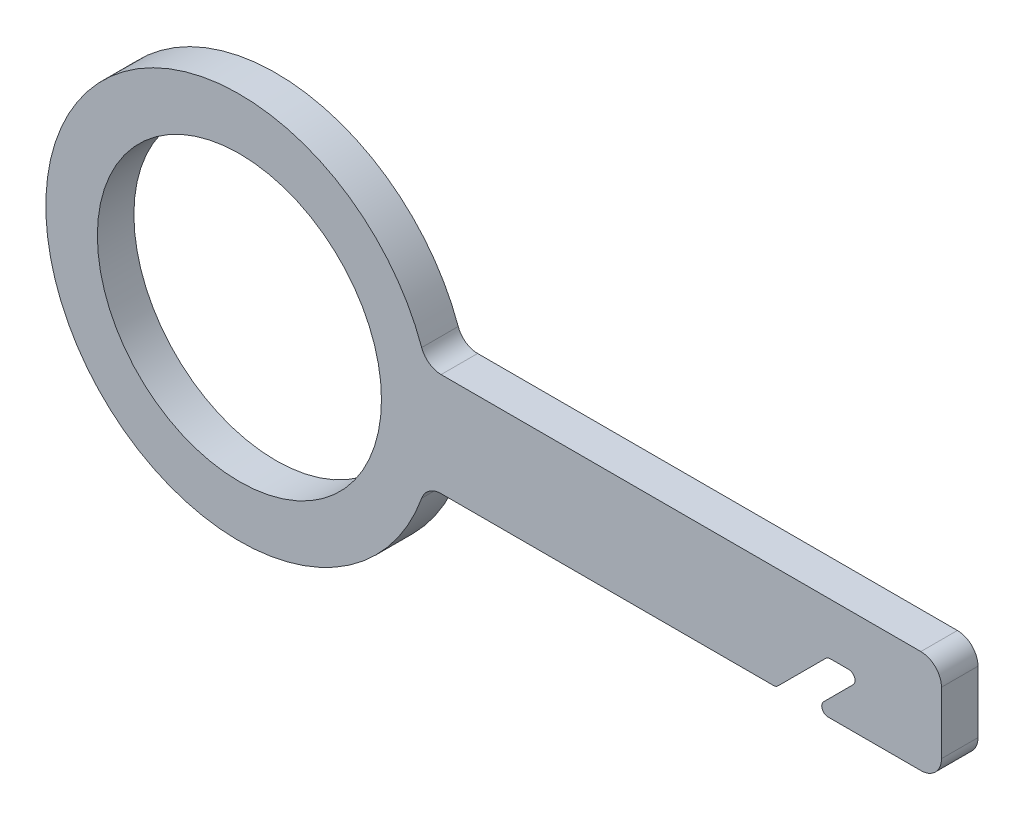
ISO-10303-21;
HEADER;
FILE_DESCRIPTION(('STEP AP214'),'2;1');
FILE_NAME('part.step','',(''),(''),'','','');
FILE_SCHEMA(('AUTOMOTIVE_DESIGN { 1 0 10303 214 1 1 1 1 }'));
ENDSEC;
DATA;
#1=APPLICATION_CONTEXT('core data for automotive mechanical design processes');
#2=APPLICATION_PROTOCOL_DEFINITION('international standard','automotive_design',2000,#1);
#3=PRODUCT_CONTEXT('',#1,'mechanical');
#4=PRODUCT('Part','Part','',(#3));
#5=PRODUCT_RELATED_PRODUCT_CATEGORY('part','',(#4));
#6=PRODUCT_DEFINITION_FORMATION('','',#4);
#7=PRODUCT_DEFINITION_CONTEXT('part definition',#1,'design');
#8=PRODUCT_DEFINITION('design','',#6,#7);
#9=PRODUCT_DEFINITION_SHAPE('','',#8);
#10=(LENGTH_UNIT() NAMED_UNIT(*) SI_UNIT(.MILLI.,.METRE.));
#11=(NAMED_UNIT(*) PLANE_ANGLE_UNIT() SI_UNIT($,.RADIAN.));
#12=(NAMED_UNIT(*) SI_UNIT($,.STERADIAN.) SOLID_ANGLE_UNIT());
#13=UNCERTAINTY_MEASURE_WITH_UNIT(LENGTH_MEASURE(1.E-05),#10,'distance_accuracy_value','');
#14=(GEOMETRIC_REPRESENTATION_CONTEXT(3) GLOBAL_UNCERTAINTY_ASSIGNED_CONTEXT((#13)) GLOBAL_UNIT_ASSIGNED_CONTEXT((#10,
#11,#12)) REPRESENTATION_CONTEXT('',''));
#15=CARTESIAN_POINT('',(0.,0.,0.));
#16=DIRECTION('',(0.,0.,1.));
#17=DIRECTION('',(1.,0.,0.));
#18=AXIS2_PLACEMENT_3D('',#15,#16,#17);
#19=CARTESIAN_POINT('',(0.,6.35,4.5));
#20=DIRECTION('',(0.,1.,0.));
#21=DIRECTION('',(0.,0.,1.));
#22=AXIS2_PLACEMENT_3D('',#19,#20,#21);
#23=PLANE('',#22);
#24=DIRECTION('',(1.,0.,0.));
#25=VECTOR('',#24,1.);
#26=CARTESIAN_POINT('',(0.,6.35,0.));
#27=LINE('',#26,#25);
#28=CARTESIAN_POINT('',(24.8475350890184,6.35,0.));
#29=VERTEX_POINT('',#28);
#30=CARTESIAN_POINT('',(83.9491278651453,6.35,0.));
#31=VERTEX_POINT('',#30);
#32=EDGE_CURVE('E180',#29,#31,#27,.T.);
#33=ORIENTED_EDGE('',*,*,#32,.F.);
#34=DIRECTION('',(0.,0.,-1.));
#35=VECTOR('',#34,1.);
#36=CARTESIAN_POINT('',(24.8475350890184,6.35,4.5));
#37=LINE('',#36,#35);
#38=CARTESIAN_POINT('',(24.8475350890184,6.35,4.5));
#39=VERTEX_POINT('',#38);
#40=EDGE_CURVE('E155',#29,#39,#37,.F.);
#41=ORIENTED_EDGE('',*,*,#40,.T.);
#42=DIRECTION('',(1.,0.,0.));
#43=VECTOR('',#42,1.);
#44=CARTESIAN_POINT('',(0.,6.35,4.5));
#45=LINE('',#44,#43);
#46=CARTESIAN_POINT('',(83.9491278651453,6.35,4.5));
#47=VERTEX_POINT('',#46);
#48=EDGE_CURVE('E202',#39,#47,#45,.T.);
#49=ORIENTED_EDGE('',*,*,#48,.T.);
#50=DIRECTION('',(0.,0.,-1.));
#51=VECTOR('',#50,1.);
#52=CARTESIAN_POINT('',(83.9491278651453,6.35,4.5));
#53=LINE('',#52,#51);
#54=EDGE_CURVE('E171',#47,#31,#53,.T.);
#55=ORIENTED_EDGE('',*,*,#54,.T.);
#56=EDGE_LOOP('',(#33,#41,#49,#55));
#57=FACE_BOUND('',#56,.T.);
#58=ADVANCED_FACE('F35',(#57),#23,.T.);
#59=CARTESIAN_POINT('',(0.,0.,4.5));
#60=DIRECTION('',(0.,0.,-1.));
#61=DIRECTION('',(-1.,0.,0.));
#62=AXIS2_PLACEMENT_3D('',#59,#60,#61);
#63=CYLINDRICAL_SURFACE('',#62,23.85);
#64=CARTESIAN_POINT('',(0.,0.,4.5));
#65=DIRECTION('',(0.,0.,1.));
#66=DIRECTION('',(1.,0.,0.));
#67=AXIS2_PLACEMENT_3D('',#64,#65,#66);
#68=CIRCLE('',#67,23.85);
#69=CARTESIAN_POINT('',(22.4559951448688,8.03435013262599,4.5));
#70=VERTEX_POINT('',#69);
#71=CARTESIAN_POINT('',(22.4559951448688,-8.03435013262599,4.5));
#72=VERTEX_POINT('',#71);
#73=EDGE_CURVE('E170',#70,#72,#68,.T.);
#74=ORIENTED_EDGE('',*,*,#73,.F.);
#75=DIRECTION('',(0.,0.,-1.));
#76=VECTOR('',#75,1.);
#77=CARTESIAN_POINT('',(22.4559951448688,8.03435013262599,4.5));
#78=LINE('',#77,#76);
#79=CARTESIAN_POINT('',(22.4559951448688,8.03435013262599,0.));
#80=VERTEX_POINT('',#79);
#81=EDGE_CURVE('E154',#70,#80,#78,.T.);
#82=ORIENTED_EDGE('',*,*,#81,.T.);
#83=CARTESIAN_POINT('',(0.,0.,0.));
#84=DIRECTION('',(0.,0.,1.));
#85=DIRECTION('',(1.,0.,0.));
#86=AXIS2_PLACEMENT_3D('',#83,#84,#85);
#87=CIRCLE('',#86,23.85);
#88=CARTESIAN_POINT('',(22.4559951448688,-8.03435013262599,0.));
#89=VERTEX_POINT('',#88);
#90=EDGE_CURVE('E167',#80,#89,#87,.T.);
#91=ORIENTED_EDGE('',*,*,#90,.T.);
#92=DIRECTION('',(0.,0.,-1.));
#93=VECTOR('',#92,1.);
#94=CARTESIAN_POINT('',(22.4559951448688,-8.03435013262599,4.5));
#95=LINE('',#94,#93);
#96=EDGE_CURVE('E172',#89,#72,#95,.F.);
#97=ORIENTED_EDGE('',*,*,#96,.T.);
#98=EDGE_LOOP('',(#74,#82,#91,#97));
#99=FACE_BOUND('',#98,.T.);
#100=ADVANCED_FACE('F166',(#99),#63,.T.);
#101=CARTESIAN_POINT('',(0.,-6.35,4.5));
#102=DIRECTION('',(0.,-1.,0.));
#103=DIRECTION('',(1.,0.,0.));
#104=AXIS2_PLACEMENT_3D('',#101,#102,#103);
#105=PLANE('',#104);
#106=DIRECTION('',(-1.,0.,0.));
#107=VECTOR('',#106,1.);
#108=CARTESIAN_POINT('',(0.,-6.35,0.));
#109=LINE('',#108,#107);
#110=CARTESIAN_POINT('',(65.7853458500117,-6.34999999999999,0.));
#111=VERTEX_POINT('',#110);
#112=CARTESIAN_POINT('',(24.8475350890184,-6.35,0.));
#113=VERTEX_POINT('',#112);
#114=EDGE_CURVE('E179',#111,#113,#109,.T.);
#115=ORIENTED_EDGE('',*,*,#114,.F.);
#116=DIRECTION('',(0.,0.,-1.));
#117=VECTOR('',#116,1.);
#118=CARTESIAN_POINT('',(65.7853458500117,-6.34999999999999,4.5));
#119=LINE('',#118,#117);
#120=CARTESIAN_POINT('',(65.7853458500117,-6.34999999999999,4.5));
#121=VERTEX_POINT('',#120);
#122=EDGE_CURVE('E58',#111,#121,#119,.F.);
#123=ORIENTED_EDGE('',*,*,#122,.T.);
#124=DIRECTION('',(-1.,0.,0.));
#125=VECTOR('',#124,1.);
#126=CARTESIAN_POINT('',(0.,-6.35,4.5));
#127=LINE('',#126,#125);
#128=CARTESIAN_POINT('',(24.8475350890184,-6.35,4.5));
#129=VERTEX_POINT('',#128);
#130=EDGE_CURVE('E283',#121,#129,#127,.T.);
#131=ORIENTED_EDGE('',*,*,#130,.T.);
#132=DIRECTION('',(0.,0.,-1.));
#133=VECTOR('',#132,1.);
#134=CARTESIAN_POINT('',(24.8475350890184,-6.35,4.5));
#135=LINE('',#134,#133);
#136=EDGE_CURVE('E161',#129,#113,#135,.T.);
#137=ORIENTED_EDGE('',*,*,#136,.T.);
#138=EDGE_LOOP('',(#115,#123,#131,#137));
#139=FACE_BOUND('',#138,.T.);
#140=ADVANCED_FACE('F309',(#139),#105,.T.);
#141=CARTESIAN_POINT('',(36.2320639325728,-36.2320639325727,4.5));
#142=DIRECTION('',(-0.707106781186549,0.707106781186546,0.));
#143=DIRECTION('',(-0.707106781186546,-0.707106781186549,0.));
#144=AXIS2_PLACEMENT_3D('',#141,#142,#143);
#145=PLANE('',#144);
#146=DIRECTION('',(0.707106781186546,0.707106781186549,0.));
#147=VECTOR('',#146,1.);
#148=CARTESIAN_POINT('',(36.2320639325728,-36.2320639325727,0.));
#149=LINE('',#148,#147);
#150=CARTESIAN_POINT('',(66.3466118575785,-6.11751600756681,0.));
#151=VERTEX_POINT('',#150);
#152=CARTESIAN_POINT('',(72.2316438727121,-0.232483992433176,0.));
#153=VERTEX_POINT('',#152);
#154=EDGE_CURVE('E182',#151,#153,#149,.T.);
#155=ORIENTED_EDGE('',*,*,#154,.T.);
#156=DIRECTION('',(0.,0.,-1.));
#157=VECTOR('',#156,1.);
#158=CARTESIAN_POINT('',(72.2316438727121,-0.232483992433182,4.5));
#159=LINE('',#158,#157);
#160=CARTESIAN_POINT('',(72.2316438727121,-0.232483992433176,4.5));
#161=VERTEX_POINT('',#160);
#162=EDGE_CURVE('E238',#153,#161,#159,.F.);
#163=ORIENTED_EDGE('',*,*,#162,.T.);
#164=DIRECTION('',(0.707106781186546,0.707106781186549,0.));
#165=VECTOR('',#164,1.);
#166=CARTESIAN_POINT('',(36.2320639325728,-36.2320639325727,4.5));
#167=LINE('',#166,#165);
#168=CARTESIAN_POINT('',(66.3466118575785,-6.11751600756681,4.5));
#169=VERTEX_POINT('',#168);
#170=EDGE_CURVE('E284',#169,#161,#167,.T.);
#171=ORIENTED_EDGE('',*,*,#170,.F.);
#172=DIRECTION('',(0.,0.,-1.));
#173=VECTOR('',#172,1.);
#174=CARTESIAN_POINT('',(66.3466118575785,-6.11751600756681,0.));
#175=LINE('',#174,#173);
#176=EDGE_CURVE('E235',#169,#151,#175,.T.);
#177=ORIENTED_EDGE('',*,*,#176,.T.);
#178=EDGE_LOOP('',(#155,#163,#171,#177));
#179=FACE_BOUND('',#178,.T.);
#180=ADVANCED_FACE('F345',(#179),#145,.F.);
#181=CARTESIAN_POINT('',(0.,0.,4.5));
#182=DIRECTION('',(0.,1.,0.));
#183=DIRECTION('',(0.,0.,1.));
#184=AXIS2_PLACEMENT_3D('',#181,#182,#183);
#185=PLANE('',#184);
#186=DIRECTION('',(1.,0.,0.));
#187=VECTOR('',#186,1.);
#188=CARTESIAN_POINT('',(0.,0.,4.5));
#189=LINE('',#188,#187);
#190=CARTESIAN_POINT('',(72.792909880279,0.,4.5));
#191=VERTEX_POINT('',#190);
#192=CARTESIAN_POINT('',(75.0478458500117,0.,4.5));
#193=VERTEX_POINT('',#192);
#194=EDGE_CURVE('E275',#191,#193,#189,.T.);
#195=ORIENTED_EDGE('',*,*,#194,.F.);
#196=DIRECTION('',(0.,0.,-1.));
#197=VECTOR('',#196,1.);
#198=CARTESIAN_POINT('',(72.792909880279,0.,0.));
#199=LINE('',#198,#197);
#200=CARTESIAN_POINT('',(72.792909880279,0.,0.));
#201=VERTEX_POINT('',#200);
#202=EDGE_CURVE('E232',#191,#201,#199,.T.);
#203=ORIENTED_EDGE('',*,*,#202,.T.);
#204=DIRECTION('',(1.,0.,0.));
#205=VECTOR('',#204,1.);
#206=CARTESIAN_POINT('',(0.,0.,0.));
#207=LINE('',#206,#205);
#208=CARTESIAN_POINT('',(75.0478458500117,0.,0.));
#209=VERTEX_POINT('',#208);
#210=EDGE_CURVE('E190',#201,#209,#207,.T.);
#211=ORIENTED_EDGE('',*,*,#210,.T.);
#212=DIRECTION('',(0.,0.,-1.));
#213=VECTOR('',#212,1.);
#214=CARTESIAN_POINT('',(75.0478458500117,0.,4.5));
#215=LINE('',#214,#213);
#216=EDGE_CURVE('E230',#209,#193,#215,.F.);
#217=ORIENTED_EDGE('',*,*,#216,.T.);
#218=EDGE_LOOP('',(#195,#203,#211,#217));
#219=FACE_BOUND('',#218,.T.);
#220=ADVANCED_FACE('F266',(#219),#185,.F.);
#221=CARTESIAN_POINT('',(38.4820639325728,-38.4820639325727,4.5));
#222=DIRECTION('',(0.707106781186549,-0.707106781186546,0.));
#223=DIRECTION('',(0.707106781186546,0.707106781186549,0.));
#224=AXIS2_PLACEMENT_3D('',#221,#222,#223);
#225=PLANE('',#224);
#226=DIRECTION('',(-0.707106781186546,-0.707106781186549,0.));
#227=VECTOR('',#226,1.);
#228=CARTESIAN_POINT('',(38.4820639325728,-38.4820639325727,4.5));
#229=LINE('',#228,#227);
#230=CARTESIAN_POINT('',(75.6091118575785,-1.35501600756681,4.5));
#231=VERTEX_POINT('',#230);
#232=CARTESIAN_POINT('',(71.9691438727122,-4.99498399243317,4.5));
#233=VERTEX_POINT('',#232);
#234=EDGE_CURVE('E274',#231,#233,#229,.T.);
#235=ORIENTED_EDGE('',*,*,#234,.F.);
#236=DIRECTION('',(0.,0.,-1.));
#237=VECTOR('',#236,1.);
#238=CARTESIAN_POINT('',(75.6091118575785,-1.35501600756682,0.));
#239=LINE('',#238,#237);
#240=CARTESIAN_POINT('',(75.6091118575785,-1.35501600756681,0.));
#241=VERTEX_POINT('',#240);
#242=EDGE_CURVE('E242',#231,#241,#239,.T.);
#243=ORIENTED_EDGE('',*,*,#242,.T.);
#244=DIRECTION('',(-0.707106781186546,-0.707106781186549,0.));
#245=VECTOR('',#244,1.);
#246=CARTESIAN_POINT('',(38.4820639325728,-38.4820639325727,0.));
#247=LINE('',#246,#245);
#248=CARTESIAN_POINT('',(71.9691438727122,-4.99498399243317,0.));
#249=VERTEX_POINT('',#248);
#250=EDGE_CURVE('E193',#241,#249,#247,.T.);
#251=ORIENTED_EDGE('',*,*,#250,.T.);
#252=DIRECTION('',(0.,0.,-1.));
#253=VECTOR('',#252,1.);
#254=CARTESIAN_POINT('',(71.9691438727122,-4.99498399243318,4.5));
#255=LINE('',#254,#253);
#256=EDGE_CURVE('E240',#249,#233,#255,.F.);
#257=ORIENTED_EDGE('',*,*,#256,.T.);
#258=EDGE_LOOP('',(#235,#243,#251,#257));
#259=FACE_BOUND('',#258,.T.);
#260=ADVANCED_FACE('F277',(#259),#225,.F.);
#261=CARTESIAN_POINT('',(83.9491278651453,-6.34999999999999,4.5));
#262=VERTEX_POINT('',#261);
#263=CARTESIAN_POINT('',(72.530409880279,-6.34999999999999,4.5));
#264=VERTEX_POINT('',#263);
#265=EDGE_CURVE('E279',#262,#264,#127,.T.);
#266=ORIENTED_EDGE('',*,*,#265,.T.);
#267=DIRECTION('',(0.,0.,-1.));
#268=VECTOR('',#267,1.);
#269=CARTESIAN_POINT('',(72.530409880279,-6.34999999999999,0.));
#270=LINE('',#269,#268);
#271=CARTESIAN_POINT('',(72.530409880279,-6.34999999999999,0.));
#272=VERTEX_POINT('',#271);
#273=EDGE_CURVE('E253',#264,#272,#270,.T.);
#274=ORIENTED_EDGE('',*,*,#273,.T.);
#275=CARTESIAN_POINT('',(83.9491278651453,-6.34999999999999,0.));
#276=VERTEX_POINT('',#275);
#277=EDGE_CURVE('E184',#276,#272,#109,.T.);
#278=ORIENTED_EDGE('',*,*,#277,.F.);
#279=DIRECTION('',(0.,0.,-1.));
#280=VECTOR('',#279,1.);
#281=CARTESIAN_POINT('',(83.9491278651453,-6.34999999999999,4.5));
#282=LINE('',#281,#280);
#283=EDGE_CURVE('E221',#276,#262,#282,.F.);
#284=ORIENTED_EDGE('',*,*,#283,.T.);
#285=EDGE_LOOP('',(#266,#274,#278,#284));
#286=FACE_BOUND('',#285,.T.);
#287=ADVANCED_FACE('F363',(#286),#105,.T.);
#288=CARTESIAN_POINT('',(86.4891278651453,0.,4.5));
#289=DIRECTION('',(1.,0.,0.));
#290=DIRECTION('',(0.,0.,-1.));
#291=AXIS2_PLACEMENT_3D('',#288,#289,#290);
#292=PLANE('',#291);
#293=DIRECTION('',(0.,-1.,0.));
#294=VECTOR('',#293,1.);
#295=CARTESIAN_POINT('',(86.4891278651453,0.,0.));
#296=LINE('',#295,#294);
#297=CARTESIAN_POINT('',(86.4891278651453,3.81,0.));
#298=VERTEX_POINT('',#297);
#299=CARTESIAN_POINT('',(86.4891278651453,-3.80999999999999,0.));
#300=VERTEX_POINT('',#299);
#301=EDGE_CURVE('E196',#298,#300,#296,.T.);
#302=ORIENTED_EDGE('',*,*,#301,.F.);
#303=DIRECTION('',(0.,0.,-1.));
#304=VECTOR('',#303,1.);
#305=CARTESIAN_POINT('',(86.4891278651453,3.81,4.5));
#306=LINE('',#305,#304);
#307=CARTESIAN_POINT('',(86.4891278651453,3.81,4.5));
#308=VERTEX_POINT('',#307);
#309=EDGE_CURVE('E215',#298,#308,#306,.F.);
#310=ORIENTED_EDGE('',*,*,#309,.T.);
#311=DIRECTION('',(0.,-1.,0.));
#312=VECTOR('',#311,1.);
#313=CARTESIAN_POINT('',(86.4891278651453,0.,4.5));
#314=LINE('',#313,#312);
#315=CARTESIAN_POINT('',(86.4891278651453,-3.80999999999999,4.5));
#316=VERTEX_POINT('',#315);
#317=EDGE_CURVE('E281',#308,#316,#314,.T.);
#318=ORIENTED_EDGE('',*,*,#317,.T.);
#319=DIRECTION('',(0.,0.,-1.));
#320=VECTOR('',#319,1.);
#321=CARTESIAN_POINT('',(86.4891278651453,-3.80999999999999,4.5));
#322=LINE('',#321,#320);
#323=EDGE_CURVE('E212',#316,#300,#322,.T.);
#324=ORIENTED_EDGE('',*,*,#323,.T.);
#325=EDGE_LOOP('',(#302,#310,#318,#324));
#326=FACE_BOUND('',#325,.T.);
#327=ADVANCED_FACE('F301',(#326),#292,.T.);
#328=CARTESIAN_POINT('',(0.,0.,4.5));
#329=DIRECTION('',(0.,0.,-1.));
#330=DIRECTION('',(-1.,0.,0.));
#331=AXIS2_PLACEMENT_3D('',#328,#329,#330);
#332=CYLINDRICAL_SURFACE('',#331,17.5);
#333=CARTESIAN_POINT('',(0.,0.,4.5));
#334=DIRECTION('',(0.,0.,1.));
#335=DIRECTION('',(1.,0.,0.));
#336=AXIS2_PLACEMENT_3D('',#333,#334,#335);
#337=CIRCLE('',#336,17.5);
#338=CARTESIAN_POINT('',(17.5,0.,4.5));
#339=VERTEX_POINT('',#338);
#340=EDGE_CURVE('E203',#339,#339,#337,.T.);
#341=ORIENTED_EDGE('',*,*,#340,.T.);
#342=EDGE_LOOP('',(#341));
#343=FACE_BOUND('',#342,.T.);
#344=CARTESIAN_POINT('',(0.,0.,0.));
#345=DIRECTION('',(0.,0.,1.));
#346=DIRECTION('',(1.,0.,0.));
#347=AXIS2_PLACEMENT_3D('',#344,#345,#346);
#348=CIRCLE('',#347,17.5);
#349=CARTESIAN_POINT('',(17.5,0.,0.));
#350=VERTEX_POINT('',#349);
#351=EDGE_CURVE('E199',#350,#350,#348,.T.);
#352=ORIENTED_EDGE('',*,*,#351,.F.);
#353=EDGE_LOOP('',(#352));
#354=FACE_BOUND('',#353,.T.);
#355=ADVANCED_FACE('F292',(#343,#354),#332,.F.);
#356=CARTESIAN_POINT('',(0.,0.,4.5));
#357=DIRECTION('',(0.,0.,1.));
#358=DIRECTION('',(1.,0.,0.));
#359=AXIS2_PLACEMENT_3D('',#356,#357,#358);
#360=PLANE('',#359);
#361=ORIENTED_EDGE('',*,*,#130,.F.);
#362=CARTESIAN_POINT('',(65.7853458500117,-5.55624999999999,4.5));
#363=DIRECTION('',(0.,0.,1.));
#364=DIRECTION('',(1.,0.,0.));
#365=AXIS2_PLACEMENT_3D('',#362,#363,#364);
#366=CIRCLE('',#365,0.79375);
#367=EDGE_CURVE('E251',#121,#169,#366,.T.);
#368=ORIENTED_EDGE('',*,*,#367,.T.);
#369=ORIENTED_EDGE('',*,*,#170,.T.);
#370=CARTESIAN_POINT('',(72.792909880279,-0.79375,4.5));
#371=DIRECTION('',(0.,0.,1.));
#372=DIRECTION('',(1.,0.,0.));
#373=AXIS2_PLACEMENT_3D('',#370,#371,#372);
#374=CIRCLE('',#373,0.79375);
#375=EDGE_CURVE('E258',#161,#191,#374,.F.);
#376=ORIENTED_EDGE('',*,*,#375,.T.);
#377=ORIENTED_EDGE('',*,*,#194,.T.);
#378=CARTESIAN_POINT('',(75.0478458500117,-0.793750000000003,4.5));
#379=DIRECTION('',(0.,0.,1.));
#380=DIRECTION('',(1.,0.,0.));
#381=AXIS2_PLACEMENT_3D('',#378,#379,#380);
#382=CIRCLE('',#381,0.79375);
#383=EDGE_CURVE('E11',#193,#231,#382,.F.);
#384=ORIENTED_EDGE('',*,*,#383,.T.);
#385=ORIENTED_EDGE('',*,*,#234,.T.);
#386=CARTESIAN_POINT('',(72.530409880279,-5.55624999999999,4.5));
#387=DIRECTION('',(0.,0.,1.));
#388=DIRECTION('',(1.,0.,0.));
#389=AXIS2_PLACEMENT_3D('',#386,#387,#388);
#390=CIRCLE('',#389,0.79375);
#391=EDGE_CURVE('E50',#233,#264,#390,.T.);
#392=ORIENTED_EDGE('',*,*,#391,.T.);
#393=ORIENTED_EDGE('',*,*,#265,.F.);
#394=CARTESIAN_POINT('',(83.9491278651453,-3.80999999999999,4.5));
#395=DIRECTION('',(0.,0.,1.));
#396=DIRECTION('',(1.,0.,0.));
#397=AXIS2_PLACEMENT_3D('',#394,#395,#396);
#398=CIRCLE('',#397,2.54);
#399=EDGE_CURVE('E217',#262,#316,#398,.T.);
#400=ORIENTED_EDGE('',*,*,#399,.T.);
#401=ORIENTED_EDGE('',*,*,#317,.F.);
#402=CARTESIAN_POINT('',(83.9491278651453,3.81,4.5));
#403=DIRECTION('',(0.,0.,1.));
#404=DIRECTION('',(1.,0.,0.));
#405=AXIS2_PLACEMENT_3D('',#402,#403,#404);
#406=CIRCLE('',#405,2.54);
#407=EDGE_CURVE('E219',#308,#47,#406,.T.);
#408=ORIENTED_EDGE('',*,*,#407,.T.);
#409=ORIENTED_EDGE('',*,*,#48,.F.);
#410=CARTESIAN_POINT('',(24.8475350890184,8.89,4.5));
#411=DIRECTION('',(0.,0.,1.));
#412=DIRECTION('',(1.,0.,0.));
#413=AXIS2_PLACEMENT_3D('',#410,#411,#412);
#414=CIRCLE('',#413,2.54);
#415=EDGE_CURVE('E160',#39,#70,#414,.F.);
#416=ORIENTED_EDGE('',*,*,#415,.T.);
#417=ORIENTED_EDGE('',*,*,#73,.T.);
#418=CARTESIAN_POINT('',(24.8475350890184,-8.89,4.5));
#419=DIRECTION('',(0.,0.,1.));
#420=DIRECTION('',(1.,0.,0.));
#421=AXIS2_PLACEMENT_3D('',#418,#419,#420);
#422=CIRCLE('',#421,2.54);
#423=EDGE_CURVE('E227',#72,#129,#422,.F.);
#424=ORIENTED_EDGE('',*,*,#423,.T.);
#425=EDGE_LOOP('',(#361,#368,#369,#376,#377,#384,#385,#392,#393,#400,#401,#408,#409,#416,#417,#424));
#426=FACE_BOUND('',#425,.T.);
#427=ORIENTED_EDGE('',*,*,#340,.F.);
#428=EDGE_LOOP('',(#427));
#429=FACE_BOUND('',#428,.T.);
#430=ADVANCED_FACE('F272',(#426,#429),#360,.T.);
#431=CARTESIAN_POINT('',(0.,0.,0.));
#432=DIRECTION('',(0.,0.,1.));
#433=DIRECTION('',(1.,0.,0.));
#434=AXIS2_PLACEMENT_3D('',#431,#432,#433);
#435=PLANE('',#434);
#436=ORIENTED_EDGE('',*,*,#154,.F.);
#437=CARTESIAN_POINT('',(65.7853458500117,-5.55624999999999,0.));
#438=DIRECTION('',(0.,0.,1.));
#439=DIRECTION('',(1.,0.,0.));
#440=AXIS2_PLACEMENT_3D('',#437,#438,#439);
#441=CIRCLE('',#440,0.79375);
#442=EDGE_CURVE('E247',#151,#111,#441,.F.);
#443=ORIENTED_EDGE('',*,*,#442,.T.);
#444=ORIENTED_EDGE('',*,*,#114,.T.);
#445=CARTESIAN_POINT('',(24.8475350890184,-8.89,0.));
#446=DIRECTION('',(0.,0.,1.));
#447=DIRECTION('',(1.,0.,0.));
#448=AXIS2_PLACEMENT_3D('',#445,#446,#447);
#449=CIRCLE('',#448,2.54);
#450=EDGE_CURVE('E178',#113,#89,#449,.T.);
#451=ORIENTED_EDGE('',*,*,#450,.T.);
#452=ORIENTED_EDGE('',*,*,#90,.F.);
#453=CARTESIAN_POINT('',(24.8475350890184,8.89,0.));
#454=DIRECTION('',(0.,0.,1.));
#455=DIRECTION('',(1.,0.,0.));
#456=AXIS2_PLACEMENT_3D('',#453,#454,#455);
#457=CIRCLE('',#456,2.54);
#458=EDGE_CURVE('E150',#80,#29,#457,.T.);
#459=ORIENTED_EDGE('',*,*,#458,.T.);
#460=ORIENTED_EDGE('',*,*,#32,.T.);
#461=CARTESIAN_POINT('',(83.9491278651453,3.81,0.));
#462=DIRECTION('',(0.,0.,1.));
#463=DIRECTION('',(1.,0.,0.));
#464=AXIS2_PLACEMENT_3D('',#461,#462,#463);
#465=CIRCLE('',#464,2.54);
#466=EDGE_CURVE('E210',#31,#298,#465,.F.);
#467=ORIENTED_EDGE('',*,*,#466,.T.);
#468=ORIENTED_EDGE('',*,*,#301,.T.);
#469=CARTESIAN_POINT('',(83.9491278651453,-3.80999999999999,0.));
#470=DIRECTION('',(0.,0.,1.));
#471=DIRECTION('',(1.,0.,0.));
#472=AXIS2_PLACEMENT_3D('',#469,#470,#471);
#473=CIRCLE('',#472,2.54);
#474=EDGE_CURVE('E208',#300,#276,#473,.F.);
#475=ORIENTED_EDGE('',*,*,#474,.T.);
#476=ORIENTED_EDGE('',*,*,#277,.T.);
#477=CARTESIAN_POINT('',(72.530409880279,-5.55624999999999,0.));
#478=DIRECTION('',(0.,0.,1.));
#479=DIRECTION('',(1.,0.,0.));
#480=AXIS2_PLACEMENT_3D('',#477,#478,#479);
#481=CIRCLE('',#480,0.79375);
#482=EDGE_CURVE('E245',#272,#249,#481,.F.);
#483=ORIENTED_EDGE('',*,*,#482,.T.);
#484=ORIENTED_EDGE('',*,*,#250,.F.);
#485=CARTESIAN_POINT('',(75.0478458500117,-0.793750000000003,0.));
#486=DIRECTION('',(0.,0.,1.));
#487=DIRECTION('',(1.,0.,0.));
#488=AXIS2_PLACEMENT_3D('',#485,#486,#487);
#489=CIRCLE('',#488,0.79375);
#490=EDGE_CURVE('E43',#241,#209,#489,.T.);
#491=ORIENTED_EDGE('',*,*,#490,.T.);
#492=ORIENTED_EDGE('',*,*,#210,.F.);
#493=CARTESIAN_POINT('',(72.792909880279,-0.79375,0.));
#494=DIRECTION('',(0.,0.,1.));
#495=DIRECTION('',(1.,0.,0.));
#496=AXIS2_PLACEMENT_3D('',#493,#494,#495);
#497=CIRCLE('',#496,0.79375);
#498=EDGE_CURVE('E256',#201,#153,#497,.T.);
#499=ORIENTED_EDGE('',*,*,#498,.T.);
#500=EDGE_LOOP('',(#436,#443,#444,#451,#452,#459,#460,#467,#468,#475,#476,#483,#484,#491,#492,#499));
#501=FACE_BOUND('',#500,.T.);
#502=ORIENTED_EDGE('',*,*,#351,.T.);
#503=EDGE_LOOP('',(#502));
#504=FACE_BOUND('',#503,.T.);
#505=ADVANCED_FACE('F175',(#501,#504),#435,.F.);
#506=CARTESIAN_POINT('',(24.8475350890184,8.89,4.5));
#507=DIRECTION('',(0.,0.,-1.));
#508=DIRECTION('',(-1.,0.,0.));
#509=AXIS2_PLACEMENT_3D('',#506,#507,#508);
#510=CYLINDRICAL_SURFACE('',#509,2.54);
#511=ORIENTED_EDGE('',*,*,#415,.F.);
#512=ORIENTED_EDGE('',*,*,#40,.F.);
#513=ORIENTED_EDGE('',*,*,#458,.F.);
#514=ORIENTED_EDGE('',*,*,#81,.F.);
#515=EDGE_LOOP('',(#511,#512,#513,#514));
#516=FACE_BOUND('',#515,.T.);
#517=ADVANCED_FACE('F153',(#516),#510,.F.);
#518=CARTESIAN_POINT('',(83.9491278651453,3.81,4.5));
#519=DIRECTION('',(0.,0.,-1.));
#520=DIRECTION('',(-1.,0.,0.));
#521=AXIS2_PLACEMENT_3D('',#518,#519,#520);
#522=CYLINDRICAL_SURFACE('',#521,2.54);
#523=ORIENTED_EDGE('',*,*,#407,.F.);
#524=ORIENTED_EDGE('',*,*,#309,.F.);
#525=ORIENTED_EDGE('',*,*,#466,.F.);
#526=ORIENTED_EDGE('',*,*,#54,.F.);
#527=EDGE_LOOP('',(#523,#524,#525,#526));
#528=FACE_BOUND('',#527,.T.);
#529=ADVANCED_FACE('F315',(#528),#522,.T.);
#530=CARTESIAN_POINT('',(83.9491278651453,-3.80999999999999,4.5));
#531=DIRECTION('',(0.,0.,-1.));
#532=DIRECTION('',(-1.,0.,0.));
#533=AXIS2_PLACEMENT_3D('',#530,#531,#532);
#534=CYLINDRICAL_SURFACE('',#533,2.54);
#535=ORIENTED_EDGE('',*,*,#399,.F.);
#536=ORIENTED_EDGE('',*,*,#283,.F.);
#537=ORIENTED_EDGE('',*,*,#474,.F.);
#538=ORIENTED_EDGE('',*,*,#323,.F.);
#539=EDGE_LOOP('',(#535,#536,#537,#538));
#540=FACE_BOUND('',#539,.T.);
#541=ADVANCED_FACE('F318',(#540),#534,.T.);
#542=CARTESIAN_POINT('',(24.8475350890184,-8.89,4.5));
#543=DIRECTION('',(0.,0.,-1.));
#544=DIRECTION('',(-1.,0.,0.));
#545=AXIS2_PLACEMENT_3D('',#542,#543,#544);
#546=CYLINDRICAL_SURFACE('',#545,2.54);
#547=ORIENTED_EDGE('',*,*,#423,.F.);
#548=ORIENTED_EDGE('',*,*,#96,.F.);
#549=ORIENTED_EDGE('',*,*,#450,.F.);
#550=ORIENTED_EDGE('',*,*,#136,.F.);
#551=EDGE_LOOP('',(#547,#548,#549,#550));
#552=FACE_BOUND('',#551,.T.);
#553=ADVANCED_FACE('F322',(#552),#546,.F.);
#554=CARTESIAN_POINT('',(72.792909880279,-0.79375,4.5));
#555=DIRECTION('',(0.,0.,1.));
#556=DIRECTION('',(1.,0.,0.));
#557=AXIS2_PLACEMENT_3D('',#554,#555,#556);
#558=CYLINDRICAL_SURFACE('',#557,0.79375);
#559=ORIENTED_EDGE('',*,*,#375,.F.);
#560=ORIENTED_EDGE('',*,*,#162,.F.);
#561=ORIENTED_EDGE('',*,*,#498,.F.);
#562=ORIENTED_EDGE('',*,*,#202,.F.);
#563=EDGE_LOOP('',(#559,#560,#561,#562));
#564=FACE_BOUND('',#563,.T.);
#565=ADVANCED_FACE('F326',(#564),#558,.F.);
#566=CARTESIAN_POINT('',(75.0478458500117,-0.793750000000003,4.5));
#567=DIRECTION('',(0.,0.,1.));
#568=DIRECTION('',(1.,0.,0.));
#569=AXIS2_PLACEMENT_3D('',#566,#567,#568);
#570=CYLINDRICAL_SURFACE('',#569,0.79375);
#571=ORIENTED_EDGE('',*,*,#383,.F.);
#572=ORIENTED_EDGE('',*,*,#216,.F.);
#573=ORIENTED_EDGE('',*,*,#490,.F.);
#574=ORIENTED_EDGE('',*,*,#242,.F.);
#575=EDGE_LOOP('',(#571,#572,#573,#574));
#576=FACE_BOUND('',#575,.T.);
#577=ADVANCED_FACE('F270',(#576),#570,.F.);
#578=CARTESIAN_POINT('',(65.7853458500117,-5.55624999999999,4.5));
#579=DIRECTION('',(0.,0.,1.));
#580=DIRECTION('',(1.,0.,0.));
#581=AXIS2_PLACEMENT_3D('',#578,#579,#580);
#582=CYLINDRICAL_SURFACE('',#581,0.79375);
#583=ORIENTED_EDGE('',*,*,#367,.F.);
#584=ORIENTED_EDGE('',*,*,#122,.F.);
#585=ORIENTED_EDGE('',*,*,#442,.F.);
#586=ORIENTED_EDGE('',*,*,#176,.F.);
#587=EDGE_LOOP('',(#583,#584,#585,#586));
#588=FACE_BOUND('',#587,.T.);
#589=ADVANCED_FACE('F332',(#588),#582,.T.);
#590=CARTESIAN_POINT('',(72.530409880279,-5.55624999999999,4.5));
#591=DIRECTION('',(0.,0.,1.));
#592=DIRECTION('',(1.,0.,0.));
#593=AXIS2_PLACEMENT_3D('',#590,#591,#592);
#594=CYLINDRICAL_SURFACE('',#593,0.79375);
#595=ORIENTED_EDGE('',*,*,#391,.F.);
#596=ORIENTED_EDGE('',*,*,#256,.F.);
#597=ORIENTED_EDGE('',*,*,#482,.F.);
#598=ORIENTED_EDGE('',*,*,#273,.F.);
#599=EDGE_LOOP('',(#595,#596,#597,#598));
#600=FACE_BOUND('',#599,.T.);
#601=ADVANCED_FACE('F37',(#600),#594,.T.);
#602=CLOSED_SHELL('',(#58,#100,#140,#180,#220,#260,#287,#327,#355,#430,#505,#517,#529,#541,#553,
#565,#577,#589,#601));
#603=MANIFOLD_SOLID_BREP('B2',#602);
#604=ADVANCED_BREP_SHAPE_REPRESENTATION('',(#18,#603),#14);
#605=SHAPE_DEFINITION_REPRESENTATION(#9,#604);
ENDSEC;
END-ISO-10303-21;
